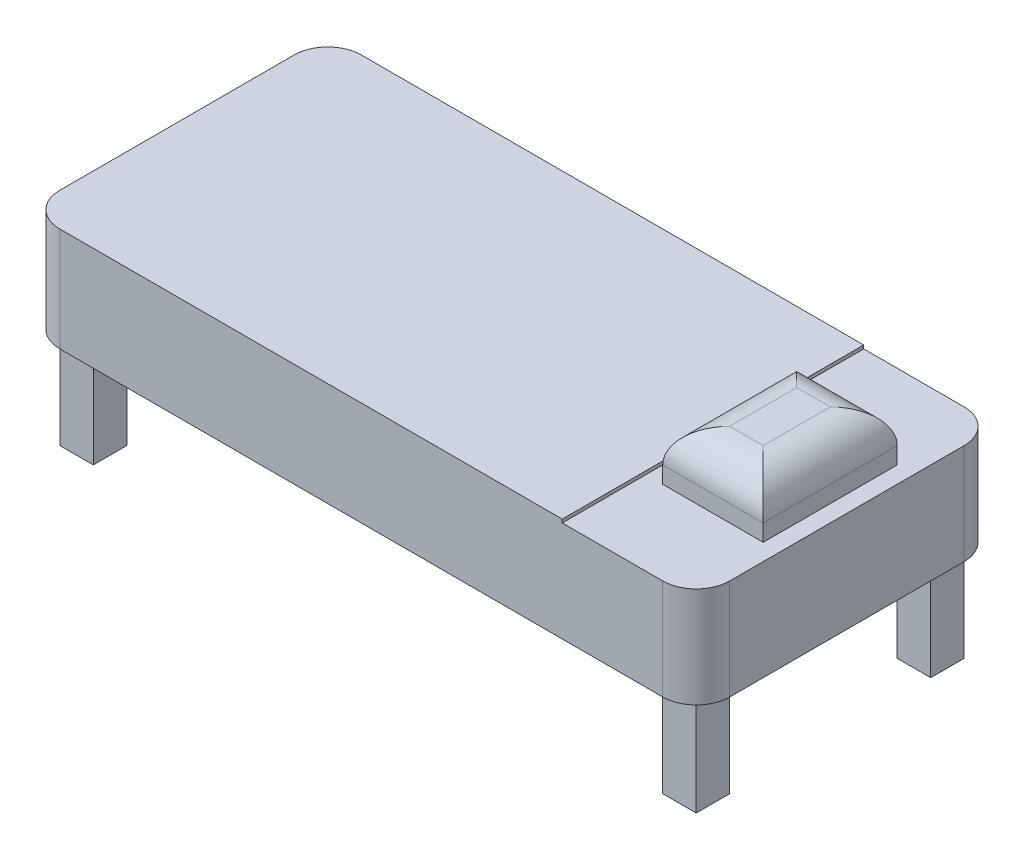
from build123d import *

# Parameters (mm, degrees)
ESQUISSE1_W               = 2000
ESQUISSE1_H               = 900
BOSS_EXTRU_1_DEPTH        = 300
ESQUISSE2_W               = 100
ESQUISSE2_H               = 100
BOSS_EXTRU_2_DEPTH        = 300
SYM_TRIE2_COPY_1_SKETCH_W = 100
SYM_TRIE2_COPY_1_SKETCH_H = 100
SYM_TRIE2_COPY_1_DEPTH    = 300
ESQUISSE3_W               = 1600
ESQUISSE3_H               = 900
BOSS_EXTRU_3_DEPTH        = 10
ESQUISSE4_W               = 300
ESQUISSE4_H               = 400
BOSS_EXTRU_4_DEPTH        = 150
CONG_2_R                  = 100
CONG_3_R                  = 100


with BuildPart() as part:
    # Esquisse1 → Boss.-Extru.1 (new body)
    with BuildSketch(Plane(origin=(0, 0, 0), x_dir=(1, 0, 0), z_dir=(0, 1, 0))):
        Rectangle(ESQUISSE1_W, ESQUISSE1_H)
    extrude(amount=BOSS_EXTRU_1_DEPTH)

    # Esquisse2 → Boss.-Extru.2 (add)
    with BuildSketch(Plane.XZ):
        with Locations((-900, 350)):
            Rectangle(ESQUISSE2_W, ESQUISSE2_H)
    boss_extru_2 = extrude(amount=BOSS_EXTRU_2_DEPTH)

    # Sym_trie1: Boss.-Extru.2 across plane
    add(boss_extru_2.mirror(Plane.XY))

    # Sym_trie2: Boss.-Extru.2 across plane
    add(boss_extru_2.mirror(Plane(origin=(0, 0, 0), x_dir=(0, 0, 1), z_dir=(1, 0, 0))))

    # Sym_trie2 copy 1 sketch → Sym_trie2 copy 1 (add)
    with BuildSketch(Plane(origin=(0, 0, 0), x_dir=(-1, 0, 0), z_dir=(0, -1, 0))):
        with Locations((-900, 350)):
            Rectangle(SYM_TRIE2_COPY_1_SKETCH_W, SYM_TRIE2_COPY_1_SKETCH_H)
    extrude(amount=SYM_TRIE2_COPY_1_DEPTH)

    # Esquisse3 → Boss.-Extru.3 (add)
    with BuildSketch(Plane(origin=(0, 300, 0), x_dir=(1, 0, 0), z_dir=(0, 1, 0))):
        with Locations((-200, 0)):
            Rectangle(ESQUISSE3_W, ESQUISSE3_H)
    extrude(amount=BOSS_EXTRU_3_DEPTH)

    # Esquisse4 → Boss.-Extru.4 (add)
    with BuildSketch(Plane(origin=(0, 300, 0), x_dir=(1, 0, 0), z_dir=(0, 1, 0))):
        with Locations((800, 0)):
            Rectangle(ESQUISSE4_W, ESQUISSE4_H)
    extrude(amount=BOSS_EXTRU_4_DEPTH)

    # Cong_2
    cong_2_edges = [part.edges().sort_by_distance(p)[0] for p in [
        (650, 450, 0),
        (800, 450, 200),
        (950, 450, 0),
        (800, 450, -200),
    ]]
    fillet(cong_2_edges, radius=CONG_2_R)

    # Cong_3
    cong_3_edges = [part.edges().sort_by_distance(p)[0] for p in [
        (1000, 150, -450),
        (1000, 150, 450),
        (-1000, 155, 450),
        (-1000, 155, -450),
    ]]
    fillet(cong_3_edges, radius=CONG_3_R)


solid = part.part
